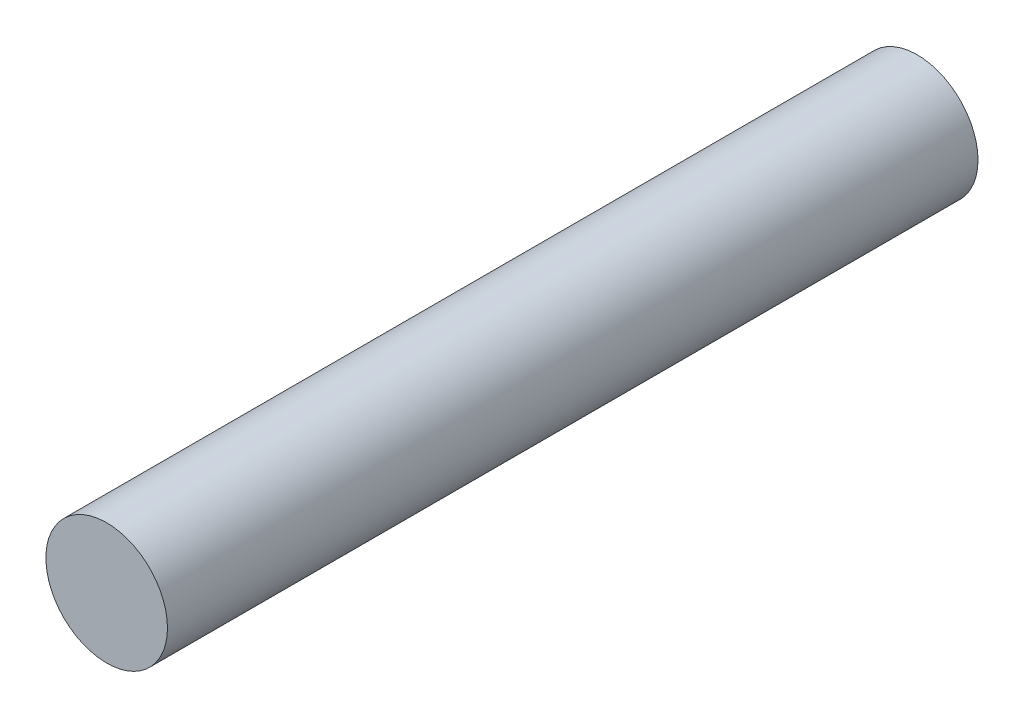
from build123d import *

# Parameters (mm, degrees)
ESQUISSE1_R      = 1.5
EXTRUSION1_DEPTH = 20


with BuildPart() as part:
    # Esquisse1 → Extrusion1 (new body)
    with BuildSketch(Plane.XY):
        Circle(ESQUISSE1_R)
    extrude(amount=EXTRUSION1_DEPTH)


solid = part.part
